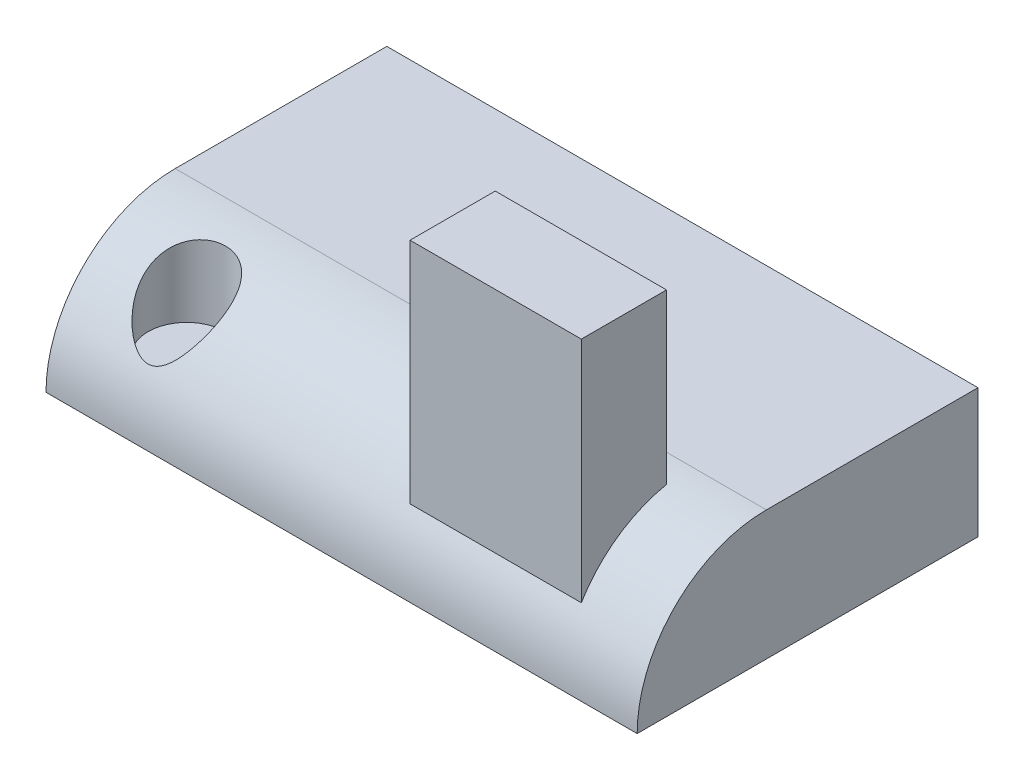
ISO-10303-21;
HEADER;
FILE_DESCRIPTION(('STEP AP214'),'2;1');
FILE_NAME('part.step','',(''),(''),'','','');
FILE_SCHEMA(('AUTOMOTIVE_DESIGN { 1 0 10303 214 1 1 1 1 }'));
ENDSEC;
DATA;
#1=APPLICATION_CONTEXT('core data for automotive mechanical design processes');
#2=APPLICATION_PROTOCOL_DEFINITION('international standard','automotive_design',2000,#1);
#3=PRODUCT_CONTEXT('',#1,'mechanical');
#4=PRODUCT('Part','Part','',(#3));
#5=PRODUCT_RELATED_PRODUCT_CATEGORY('part','',(#4));
#6=PRODUCT_DEFINITION_FORMATION('','',#4);
#7=PRODUCT_DEFINITION_CONTEXT('part definition',#1,'design');
#8=PRODUCT_DEFINITION('design','',#6,#7);
#9=PRODUCT_DEFINITION_SHAPE('','',#8);
#10=(LENGTH_UNIT() NAMED_UNIT(*) SI_UNIT(.MILLI.,.METRE.));
#11=(NAMED_UNIT(*) PLANE_ANGLE_UNIT() SI_UNIT($,.RADIAN.));
#12=(NAMED_UNIT(*) SI_UNIT($,.STERADIAN.) SOLID_ANGLE_UNIT());
#13=UNCERTAINTY_MEASURE_WITH_UNIT(LENGTH_MEASURE(1.E-05),#10,'distance_accuracy_value','');
#14=(GEOMETRIC_REPRESENTATION_CONTEXT(3) GLOBAL_UNCERTAINTY_ASSIGNED_CONTEXT((#13)) GLOBAL_UNIT_ASSIGNED_CONTEXT((#10,
#11,#12)) REPRESENTATION_CONTEXT('',''));
#15=CARTESIAN_POINT('',(0.,0.,0.));
#16=DIRECTION('',(0.,0.,1.));
#17=DIRECTION('',(1.,0.,0.));
#18=AXIS2_PLACEMENT_3D('',#15,#16,#17);
#19=CARTESIAN_POINT('',(0.,16.51,0.));
#20=DIRECTION('',(0.,-1.,0.));
#21=DIRECTION('',(0.,0.,-1.));
#22=AXIS2_PLACEMENT_3D('',#19,#20,#21);
#23=PLANE('',#22);
#24=DIRECTION('',(0.,0.,-1.));
#25=VECTOR('',#24,1.);
#26=CARTESIAN_POINT('',(-73.6264453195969,16.51,33.3439137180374));
#27=LINE('',#26,#25);
#28=CARTESIAN_POINT('',(-73.6264453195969,16.51,0.323913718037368));
#29=VERTEX_POINT('',#28);
#30=CARTESIAN_POINT('',(-73.6264453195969,16.51,-53.7742885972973));
#31=VERTEX_POINT('',#30);
#32=EDGE_CURVE('E154',#29,#31,#27,.T.);
#33=ORIENTED_EDGE('',*,*,#32,.F.);
#34=DIRECTION('',(-1.,0.,0.));
#35=VECTOR('',#34,1.);
#36=CARTESIAN_POINT('',(0.,16.51,0.323913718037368));
#37=LINE('',#36,#35);
#38=CARTESIAN_POINT('',(77.4812330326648,16.51,0.323913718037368));
#39=VERTEX_POINT('',#38);
#40=EDGE_CURVE('E49',#29,#39,#37,.F.);
#41=ORIENTED_EDGE('',*,*,#40,.T.);
#42=DIRECTION('',(0.,0.,1.));
#43=VECTOR('',#42,1.);
#44=CARTESIAN_POINT('',(77.4812330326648,16.51,33.3439137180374));
#45=LINE('',#44,#43);
#46=CARTESIAN_POINT('',(77.4812330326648,16.51,-53.7742885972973));
#47=VERTEX_POINT('',#46);
#48=EDGE_CURVE('E157',#47,#39,#45,.T.);
#49=ORIENTED_EDGE('',*,*,#48,.F.);
#50=DIRECTION('',(1.,0.,0.));
#51=VECTOR('',#50,1.);
#52=CARTESIAN_POINT('',(-73.6264453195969,16.51,-53.7742885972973));
#53=LINE('',#52,#51);
#54=EDGE_CURVE('E97',#31,#47,#53,.T.);
#55=ORIENTED_EDGE('',*,*,#54,.F.);
#56=EDGE_LOOP('',(#33,#41,#49,#55));
#57=FACE_BOUND('',#56,.T.);
#58=ADVANCED_FACE('F35',(#57),#23,.F.);
#59=CARTESIAN_POINT('',(-73.6264453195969,-16.51,33.3439137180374));
#60=DIRECTION('',(1.,0.,0.));
#61=DIRECTION('',(0.,0.,-1.));
#62=AXIS2_PLACEMENT_3D('',#59,#60,#61);
#63=PLANE('',#62);
#64=DIRECTION('',(0.,0.,-1.));
#65=VECTOR('',#64,1.);
#66=CARTESIAN_POINT('',(-73.6264453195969,-16.51,33.3439137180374));
#67=LINE('',#66,#65);
#68=CARTESIAN_POINT('',(-73.6264453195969,-16.51,33.3439137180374));
#69=VERTEX_POINT('',#68);
#70=CARTESIAN_POINT('',(-73.6264453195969,-16.51,-53.7742885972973));
#71=VERTEX_POINT('',#70);
#72=EDGE_CURVE('E155',#69,#71,#67,.T.);
#73=ORIENTED_EDGE('',*,*,#72,.F.);
#74=CARTESIAN_POINT('',(-73.6264453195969,-16.51,0.323913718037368));
#75=DIRECTION('',(1.,0.,0.));
#76=DIRECTION('',(0.,0.,-1.));
#77=AXIS2_PLACEMENT_3D('',#74,#75,#76);
#78=CIRCLE('',#77,33.02);
#79=EDGE_CURVE('E81',#69,#29,#78,.F.);
#80=ORIENTED_EDGE('',*,*,#79,.T.);
#81=ORIENTED_EDGE('',*,*,#32,.T.);
#82=DIRECTION('',(0.,1.,0.));
#83=VECTOR('',#82,1.);
#84=CARTESIAN_POINT('',(-73.6264453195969,-16.51,-53.7742885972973));
#85=LINE('',#84,#83);
#86=EDGE_CURVE('E169',#71,#31,#85,.T.);
#87=ORIENTED_EDGE('',*,*,#86,.F.);
#88=EDGE_LOOP('',(#73,#80,#81,#87));
#89=FACE_BOUND('',#88,.T.);
#90=ADVANCED_FACE('F197',(#89),#63,.F.);
#91=CARTESIAN_POINT('',(-73.6264453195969,-16.51,-53.7742885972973));
#92=DIRECTION('',(0.,0.,1.));
#93=DIRECTION('',(1.,0.,0.));
#94=AXIS2_PLACEMENT_3D('',#91,#92,#93);
#95=PLANE('',#94);
#96=ORIENTED_EDGE('',*,*,#54,.T.);
#97=DIRECTION('',(0.,1.,0.));
#98=VECTOR('',#97,1.);
#99=CARTESIAN_POINT('',(77.4812330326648,-16.51,-53.7742885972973));
#100=LINE('',#99,#98);
#101=CARTESIAN_POINT('',(77.4812330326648,-16.51,-53.7742885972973));
#102=VERTEX_POINT('',#101);
#103=EDGE_CURVE('E164',#102,#47,#100,.T.);
#104=ORIENTED_EDGE('',*,*,#103,.F.);
#105=DIRECTION('',(1.,0.,0.));
#106=VECTOR('',#105,1.);
#107=CARTESIAN_POINT('',(-73.6264453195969,-16.51,-53.7742885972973));
#108=LINE('',#107,#106);
#109=EDGE_CURVE('E102',#71,#102,#108,.T.);
#110=ORIENTED_EDGE('',*,*,#109,.F.);
#111=ORIENTED_EDGE('',*,*,#86,.T.);
#112=EDGE_LOOP('',(#96,#104,#110,#111));
#113=FACE_BOUND('',#112,.T.);
#114=ADVANCED_FACE('F202',(#113),#95,.F.);
#115=CARTESIAN_POINT('',(77.4812330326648,-16.51,33.3439137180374));
#116=DIRECTION('',(-1.,0.,0.));
#117=DIRECTION('',(0.,0.,1.));
#118=AXIS2_PLACEMENT_3D('',#115,#116,#117);
#119=PLANE('',#118);
#120=ORIENTED_EDGE('',*,*,#48,.T.);
#121=CARTESIAN_POINT('',(77.4812330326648,-16.51,0.323913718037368));
#122=DIRECTION('',(-1.,0.,0.));
#123=DIRECTION('',(0.,0.,1.));
#124=AXIS2_PLACEMENT_3D('',#121,#122,#123);
#125=CIRCLE('',#124,33.02);
#126=CARTESIAN_POINT('',(77.4812330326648,-16.51,33.3439137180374));
#127=VERTEX_POINT('',#126);
#128=EDGE_CURVE('E11',#39,#127,#125,.F.);
#129=ORIENTED_EDGE('',*,*,#128,.T.);
#130=DIRECTION('',(0.,0.,1.));
#131=VECTOR('',#130,1.);
#132=CARTESIAN_POINT('',(77.4812330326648,-16.51,33.3439137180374));
#133=LINE('',#132,#131);
#134=EDGE_CURVE('E159',#102,#127,#133,.T.);
#135=ORIENTED_EDGE('',*,*,#134,.F.);
#136=ORIENTED_EDGE('',*,*,#103,.T.);
#137=EDGE_LOOP('',(#120,#129,#135,#136));
#138=FACE_BOUND('',#137,.T.);
#139=ADVANCED_FACE('F208',(#138),#119,.F.);
#140=CARTESIAN_POINT('',(0.,-16.51,0.));
#141=DIRECTION('',(0.,-1.,0.));
#142=DIRECTION('',(0.,0.,-1.));
#143=AXIS2_PLACEMENT_3D('',#140,#141,#142);
#144=PLANE('',#143);
#145=ORIENTED_EDGE('',*,*,#72,.T.);
#146=ORIENTED_EDGE('',*,*,#109,.T.);
#147=ORIENTED_EDGE('',*,*,#134,.T.);
#148=DIRECTION('',(-1.,0.,0.));
#149=VECTOR('',#148,1.);
#150=CARTESIAN_POINT('',(-73.6264453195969,-16.51,33.3439137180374));
#151=LINE('',#150,#149);
#152=EDGE_CURVE('E162',#127,#69,#151,.T.);
#153=ORIENTED_EDGE('',*,*,#152,.T.);
#154=EDGE_LOOP('',(#145,#146,#147,#153));
#155=FACE_BOUND('',#154,.T.);
#156=ADVANCED_FACE('F206',(#155),#144,.T.);
#157=CARTESIAN_POINT('',(58.4481436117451,58.928,28.5849174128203));
#158=DIRECTION('',(-1.,0.,0.));
#159=DIRECTION('',(0.,0.,1.));
#160=AXIS2_PLACEMENT_3D('',#157,#158,#159);
#161=PLANE('',#160);
#162=CARTESIAN_POINT('',(58.4481436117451,-16.51,0.323913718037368));
#163=DIRECTION('',(-1.,0.,0.));
#164=DIRECTION('',(0.,0.,1.));
#165=AXIS2_PLACEMENT_3D('',#162,#163,#164);
#166=CIRCLE('',#165,33.02);
#167=CARTESIAN_POINT('',(58.4481436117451,0.567355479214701,28.5849174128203));
#168=VERTEX_POINT('',#167);
#169=CARTESIAN_POINT('',(58.4481436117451,15.8665996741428,6.81053021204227));
#170=VERTEX_POINT('',#169);
#171=EDGE_CURVE('E121',#168,#170,#166,.T.);
#172=ORIENTED_EDGE('',*,*,#171,.T.);
#173=DIRECTION('',(0.,-1.,0.));
#174=VECTOR('',#173,1.);
#175=CARTESIAN_POINT('',(58.4481436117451,58.928,6.81053021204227));
#176=LINE('',#175,#174);
#177=CARTESIAN_POINT('',(58.4481436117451,58.928,6.81053021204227));
#178=VERTEX_POINT('',#177);
#179=EDGE_CURVE('E152',#178,#170,#176,.T.);
#180=ORIENTED_EDGE('',*,*,#179,.F.);
#181=DIRECTION('',(0.,0.,-1.));
#182=VECTOR('',#181,1.);
#183=CARTESIAN_POINT('',(58.4481436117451,58.928,28.5849174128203));
#184=LINE('',#183,#182);
#185=CARTESIAN_POINT('',(58.4481436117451,58.928,28.5849174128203));
#186=VERTEX_POINT('',#185);
#187=EDGE_CURVE('E139',#186,#178,#184,.T.);
#188=ORIENTED_EDGE('',*,*,#187,.F.);
#189=DIRECTION('',(0.,-1.,0.));
#190=VECTOR('',#189,1.);
#191=CARTESIAN_POINT('',(58.4481436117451,58.928,28.5849174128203));
#192=LINE('',#191,#190);
#193=EDGE_CURVE('E135',#186,#168,#192,.T.);
#194=ORIENTED_EDGE('',*,*,#193,.T.);
#195=EDGE_LOOP('',(#172,#180,#188,#194));
#196=FACE_BOUND('',#195,.T.);
#197=ADVANCED_FACE('F141',(#196),#161,.F.);
#198=CARTESIAN_POINT('',(58.4481436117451,58.928,6.81053021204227));
#199=DIRECTION('',(0.,0.,1.));
#200=DIRECTION('',(1.,0.,0.));
#201=AXIS2_PLACEMENT_3D('',#198,#199,#200);
#202=PLANE('',#201);
#203=DIRECTION('',(-1.,0.,0.));
#204=VECTOR('',#203,1.);
#205=CARTESIAN_POINT('',(36.5579352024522,15.8665996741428,6.81053021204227));
#206=LINE('',#205,#204);
#207=CARTESIAN_POINT('',(14.6677267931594,15.8665996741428,6.81053021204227));
#208=VERTEX_POINT('',#207);
#209=EDGE_CURVE('E124',#170,#208,#206,.T.);
#210=ORIENTED_EDGE('',*,*,#209,.T.);
#211=DIRECTION('',(0.,-1.,0.));
#212=VECTOR('',#211,1.);
#213=CARTESIAN_POINT('',(14.6677267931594,58.928,6.81053021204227));
#214=LINE('',#213,#212);
#215=CARTESIAN_POINT('',(14.6677267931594,58.928,6.81053021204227));
#216=VERTEX_POINT('',#215);
#217=EDGE_CURVE('E144',#216,#208,#214,.T.);
#218=ORIENTED_EDGE('',*,*,#217,.F.);
#219=DIRECTION('',(-1.,0.,0.));
#220=VECTOR('',#219,1.);
#221=CARTESIAN_POINT('',(58.4481436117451,58.928,6.81053021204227));
#222=LINE('',#221,#220);
#223=EDGE_CURVE('E118',#178,#216,#222,.T.);
#224=ORIENTED_EDGE('',*,*,#223,.F.);
#225=ORIENTED_EDGE('',*,*,#179,.T.);
#226=EDGE_LOOP('',(#210,#218,#224,#225));
#227=FACE_BOUND('',#226,.T.);
#228=ADVANCED_FACE('F177',(#227),#202,.F.);
#229=CARTESIAN_POINT('',(14.6677267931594,58.928,28.5849174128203));
#230=DIRECTION('',(1.,0.,0.));
#231=DIRECTION('',(0.,0.,-1.));
#232=AXIS2_PLACEMENT_3D('',#229,#230,#231);
#233=PLANE('',#232);
#234=CARTESIAN_POINT('',(14.6677267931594,-16.51,0.323913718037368));
#235=DIRECTION('',(1.,0.,0.));
#236=DIRECTION('',(0.,0.,-1.));
#237=AXIS2_PLACEMENT_3D('',#234,#235,#236);
#238=CIRCLE('',#237,33.02);
#239=CARTESIAN_POINT('',(14.6677267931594,0.567355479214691,28.5849174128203));
#240=VERTEX_POINT('',#239);
#241=EDGE_CURVE('E140',#208,#240,#238,.T.);
#242=ORIENTED_EDGE('',*,*,#241,.T.);
#243=DIRECTION('',(0.,-1.,0.));
#244=VECTOR('',#243,1.);
#245=CARTESIAN_POINT('',(14.6677267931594,58.928,28.5849174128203));
#246=LINE('',#245,#244);
#247=CARTESIAN_POINT('',(14.6677267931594,58.928,28.5849174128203));
#248=VERTEX_POINT('',#247);
#249=EDGE_CURVE('E138',#248,#240,#246,.T.);
#250=ORIENTED_EDGE('',*,*,#249,.F.);
#251=DIRECTION('',(0.,0.,1.));
#252=VECTOR('',#251,1.);
#253=CARTESIAN_POINT('',(14.6677267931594,58.928,28.5849174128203));
#254=LINE('',#253,#252);
#255=EDGE_CURVE('E146',#216,#248,#254,.T.);
#256=ORIENTED_EDGE('',*,*,#255,.F.);
#257=ORIENTED_EDGE('',*,*,#217,.T.);
#258=EDGE_LOOP('',(#242,#250,#256,#257));
#259=FACE_BOUND('',#258,.T.);
#260=ADVANCED_FACE('F175',(#259),#233,.F.);
#261=CARTESIAN_POINT('',(58.4481436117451,58.928,28.5849174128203));
#262=DIRECTION('',(0.,0.,-1.));
#263=DIRECTION('',(-1.,0.,0.));
#264=AXIS2_PLACEMENT_3D('',#261,#262,#263);
#265=PLANE('',#264);
#266=DIRECTION('',(-1.,0.,0.));
#267=VECTOR('',#266,1.);
#268=CARTESIAN_POINT('',(36.5579352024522,0.567355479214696,28.5849174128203));
#269=LINE('',#268,#267);
#270=EDGE_CURVE('E74',#240,#168,#269,.F.);
#271=ORIENTED_EDGE('',*,*,#270,.T.);
#272=ORIENTED_EDGE('',*,*,#193,.F.);
#273=DIRECTION('',(1.,0.,0.));
#274=VECTOR('',#273,1.);
#275=CARTESIAN_POINT('',(58.4481436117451,58.928,28.5849174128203));
#276=LINE('',#275,#274);
#277=EDGE_CURVE('E142',#248,#186,#276,.T.);
#278=ORIENTED_EDGE('',*,*,#277,.F.);
#279=ORIENTED_EDGE('',*,*,#249,.T.);
#280=EDGE_LOOP('',(#271,#272,#278,#279));
#281=FACE_BOUND('',#280,.T.);
#282=ADVANCED_FACE('F133',(#281),#265,.F.);
#283=CARTESIAN_POINT('',(0.,58.928,0.));
#284=DIRECTION('',(0.,1.,0.));
#285=DIRECTION('',(0.,0.,1.));
#286=AXIS2_PLACEMENT_3D('',#283,#284,#285);
#287=PLANE('',#286);
#288=ORIENTED_EDGE('',*,*,#187,.T.);
#289=ORIENTED_EDGE('',*,*,#223,.T.);
#290=ORIENTED_EDGE('',*,*,#255,.T.);
#291=ORIENTED_EDGE('',*,*,#277,.T.);
#292=EDGE_LOOP('',(#288,#289,#290,#291));
#293=FACE_BOUND('',#292,.T.);
#294=ADVANCED_FACE('F251',(#293),#287,.T.);
#295=CARTESIAN_POINT('',(-51.3937950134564,-3.80999999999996,19.5835826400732));
#296=DIRECTION('',(0.,1.,0.));
#297=DIRECTION('',(0.,0.,1.));
#298=AXIS2_PLACEMENT_3D('',#295,#296,#297);
#299=CYLINDRICAL_SURFACE('',#298,9.91472841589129);
#300=CARTESIAN_POINT('',(-51.3937950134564,-3.80999999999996,19.5835826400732));
#301=DIRECTION('',(0.,1.,0.));
#302=DIRECTION('',(0.,0.,1.));
#303=AXIS2_PLACEMENT_3D('',#300,#301,#302);
#304=CIRCLE('',#303,9.91472841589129);
#305=CARTESIAN_POINT('',(-51.3937950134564,-3.80999999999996,29.4983110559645));
#306=VERTEX_POINT('',#305);
#307=EDGE_CURVE('E128',#306,#306,#304,.T.);
#308=ORIENTED_EDGE('',*,*,#307,.F.);
#309=EDGE_LOOP('',(#308));
#310=FACE_BOUND('',#309,.T.);
#311=CARTESIAN_POINT('',(-51.3937950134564,15.1600566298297,9.66885422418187));
#312=CARTESIAN_POINT('',(-51.6609748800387,15.160056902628,9.66885580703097));
#313=CARTESIAN_POINT('',(-51.9282022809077,15.1568729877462,9.67966466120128));
#314=CARTESIAN_POINT('',(-52.4608645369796,15.1440908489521,9.72281923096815));
#315=CARTESIAN_POINT('',(-52.7262984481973,15.1344894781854,9.75517551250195));
#316=CARTESIAN_POINT('',(-53.2538806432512,15.1087153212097,9.84122755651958));
#317=CARTESIAN_POINT('',(-53.5160218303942,15.0925302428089,9.8949632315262));
#318=CARTESIAN_POINT('',(-54.0346314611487,15.0533803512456,10.0232907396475));
#319=CARTESIAN_POINT('',(-54.2910998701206,15.0304154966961,10.0978827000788));
#320=CARTESIAN_POINT('',(-54.7963147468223,14.9774574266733,10.2671665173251));
#321=CARTESIAN_POINT('',(-55.0450678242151,14.9474704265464,10.3618405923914));
#322=CARTESIAN_POINT('',(-55.5333365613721,14.8801393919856,10.5704523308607));
#323=CARTESIAN_POINT('',(-55.7728519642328,14.8427951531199,10.6843905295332));
#324=CARTESIAN_POINT('',(-56.2408338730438,14.7604340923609,10.9303813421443));
#325=CARTESIAN_POINT('',(-56.4693066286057,14.7154216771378,11.0624235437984));
#326=CARTESIAN_POINT('',(-56.9137965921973,14.6173733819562,11.3434035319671));
#327=CARTESIAN_POINT('',(-57.1298138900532,14.5643375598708,11.4923411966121));
#328=CARTESIAN_POINT('',(-57.548452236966,14.4498083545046,11.8060125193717));
#329=CARTESIAN_POINT('',(-57.7510425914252,14.3882965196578,11.9707803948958));
#330=CARTESIAN_POINT('',(-58.1410656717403,14.2566518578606,12.3142156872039));
#331=CARTESIAN_POINT('',(-58.3284984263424,14.1865190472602,12.4928830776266));
#332=CARTESIAN_POINT('',(-58.687191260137,14.0374523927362,12.8623837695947));
#333=CARTESIAN_POINT('',(-58.8584502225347,13.9585179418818,13.0532179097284));
#334=CARTESIAN_POINT('',(-59.1839859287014,13.791773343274,13.445205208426));
#335=CARTESIAN_POINT('',(-59.3382623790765,13.7039630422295,13.6463585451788));
#336=CARTESIAN_POINT('',(-59.6329943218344,13.5171407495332,14.0623455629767));
#337=CARTESIAN_POINT('',(-59.7729968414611,13.4179001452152,14.277397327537));
#338=CARTESIAN_POINT('',(-60.0342371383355,13.2102654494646,14.7143525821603));
#339=CARTESIAN_POINT('',(-60.1554747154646,13.1018712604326,14.9362561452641));
#340=CARTESIAN_POINT('',(-60.3791354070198,12.8761880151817,15.3849701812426));
#341=CARTESIAN_POINT('',(-60.4815573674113,12.7588984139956,15.6117809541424));
#342=CARTESIAN_POINT('',(-60.6677714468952,12.5157872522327,16.0684686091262));
#343=CARTESIAN_POINT('',(-60.7515614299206,12.3899647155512,16.2983458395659));
#344=CARTESIAN_POINT('',(-60.9070522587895,12.1195240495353,16.7784808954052));
#345=CARTESIAN_POINT('',(-60.9771851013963,11.9742116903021,17.0288552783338));
#346=CARTESIAN_POINT('',(-61.096771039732,11.6747807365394,17.5292493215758));
#347=CARTESIAN_POINT('',(-61.1462235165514,11.5206618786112,17.7792689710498));
#348=CARTESIAN_POINT('',(-61.225346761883,11.2042416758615,18.2774179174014));
#349=CARTESIAN_POINT('',(-61.255007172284,11.0419360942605,18.5255461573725));
#350=CARTESIAN_POINT('',(-61.2954896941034,10.7099429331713,19.0183903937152));
#351=CARTESIAN_POINT('',(-61.306308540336,10.5402540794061,19.2631057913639));
#352=CARTESIAN_POINT('',(-61.3109393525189,10.120262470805,19.8515883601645));
#353=CARTESIAN_POINT('',(-61.2955067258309,9.86650145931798,20.1929897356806));
#354=CARTESIAN_POINT('',(-61.2312997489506,9.3475594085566,20.8638031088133));
#355=CARTESIAN_POINT('',(-61.1825135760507,9.08237435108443,21.1932108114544));
#356=CARTESIAN_POINT('',(-61.0543095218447,8.54235151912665,21.8384973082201));
#357=CARTESIAN_POINT('',(-60.9748536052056,8.26750214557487,22.1543587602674));
#358=CARTESIAN_POINT('',(-60.7878001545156,7.71046588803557,22.7707848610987));
#359=CARTESIAN_POINT('',(-60.6802051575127,7.42827966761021,23.071350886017));
#360=CARTESIAN_POINT('',(-60.4371405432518,6.8542184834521,23.66069625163));
#361=CARTESIAN_POINT('',(-60.3012811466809,6.56226189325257,23.9492346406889));
#362=CARTESIAN_POINT('',(-60.0043381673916,5.97469228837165,24.5091096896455));
#363=CARTESIAN_POINT('',(-59.8432525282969,5.67907897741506,24.780444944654));
#364=CARTESIAN_POINT('',(-59.4968918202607,5.08621110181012,25.3055253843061));
#365=CARTESIAN_POINT('',(-59.3116084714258,4.78895600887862,25.5592645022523));
#366=CARTESIAN_POINT('',(-58.917365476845,4.19528336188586,26.0486009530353));
#367=CARTESIAN_POINT('',(-58.7084095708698,3.89886568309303,26.2842011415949));
#368=CARTESIAN_POINT('',(-58.3014375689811,3.35628250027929,26.7009692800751));
#369=CARTESIAN_POINT('',(-58.1069131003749,3.10957987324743,26.8848546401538));
#370=CARTESIAN_POINT('',(-57.7001111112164,2.62089375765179,27.2389710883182));
#371=CARTESIAN_POINT('',(-57.4878305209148,2.37891109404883,27.4091998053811));
#372=CARTESIAN_POINT('',(-57.0447485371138,1.90306435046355,27.7349048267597));
#373=CARTESIAN_POINT('',(-56.8139821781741,1.66918606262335,27.8904078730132));
#374=CARTESIAN_POINT('',(-56.3318218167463,1.21317303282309,28.1857716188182));
#375=CARTESIAN_POINT('',(-56.0804409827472,0.99103094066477,28.3256421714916));
#376=CARTESIAN_POINT('',(-55.6765961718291,0.663412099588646,28.5269707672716));
#377=CARTESIAN_POINT('',(-55.5323477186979,0.55162337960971,28.5947018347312));
#378=CARTESIAN_POINT('',(-55.2367337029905,0.334363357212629,28.7246851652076));
#379=CARTESIAN_POINT('',(-55.0853674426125,0.228892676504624,28.7869368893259));
#380=CARTESIAN_POINT('',(-54.7752398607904,0.0259072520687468,28.9053406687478));
#381=CARTESIAN_POINT('',(-54.6164848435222,-0.0716140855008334,28.9614977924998));
#382=CARTESIAN_POINT('',(-54.2912215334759,-0.256870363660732,29.0670442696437));
#383=CARTESIAN_POINT('',(-54.1247128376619,-0.344604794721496,29.1164332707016));
#384=CARTESIAN_POINT('',(-53.6853008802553,-0.555172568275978,29.233870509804));
#385=CARTESIAN_POINT('',(-53.4063499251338,-0.669120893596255,29.2962839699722));
#386=CARTESIAN_POINT('',(-52.9752255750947,-0.80952805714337,29.3724669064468));
#387=CARTESIAN_POINT('',(-52.8294403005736,-0.851237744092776,29.3949514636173));
#388=CARTESIAN_POINT('',(-52.5342819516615,-0.923240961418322,29.4336202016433));
#389=CARTESIAN_POINT('',(-52.3849107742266,-0.953540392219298,29.449807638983));
#390=CARTESIAN_POINT('',(-52.0819407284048,-1.00189283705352,29.4755823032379));
#391=CARTESIAN_POINT('',(-51.9283135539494,-1.01980914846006,29.4850958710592));
#392=CARTESIAN_POINT('',(-51.6197958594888,-1.04212076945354,29.4969367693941));
#393=CARTESIAN_POINT('',(-51.464905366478,-1.04651636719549,29.4992642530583));
#394=CARTESIAN_POINT('',(-51.1553810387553,-1.04158870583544,29.49665206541));
#395=CARTESIAN_POINT('',(-51.0007472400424,-1.0322636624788,29.4917114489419));
#396=CARTESIAN_POINT('',(-50.6933000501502,-1.00031449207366,29.4747346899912));
#397=CARTESIAN_POINT('',(-50.540486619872,-0.977690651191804,29.4626987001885));
#398=CARTESIAN_POINT('',(-50.1301320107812,-0.899441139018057,29.4208906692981));
#399=CARTESIAN_POINT('',(-49.8754821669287,-0.831787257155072,29.3845921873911));
#400=CARTESIAN_POINT('',(-49.379552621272,-0.666555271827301,29.2948362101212));
#401=CARTESIAN_POINT('',(-49.1382788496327,-0.568964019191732,29.2413711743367));
#402=CARTESIAN_POINT('',(-48.6956595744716,-0.362540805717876,29.126558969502));
#403=CARTESIAN_POINT('',(-48.4928129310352,-0.256052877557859,29.0666817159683));
#404=CARTESIAN_POINT('',(-48.0985222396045,-0.0288083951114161,28.9369849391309));
#405=CARTESIAN_POINT('',(-47.9070863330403,0.091958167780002,28.8671584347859));
#406=CARTESIAN_POINT('',(-47.5345894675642,0.344769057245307,28.71860893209));
#407=CARTESIAN_POINT('',(-47.353561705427,0.476846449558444,28.6398596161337));
#408=CARTESIAN_POINT('',(-47.0016859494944,0.7494474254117,28.4745327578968));
#409=CARTESIAN_POINT('',(-46.8308418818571,0.889974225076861,28.3879522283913));
#410=CARTESIAN_POINT('',(-46.3665378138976,1.29170914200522,28.1359971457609));
#411=CARTESIAN_POINT('',(-46.0835372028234,1.56006911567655,27.962687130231));
#412=CARTESIAN_POINT('',(-45.5443388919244,2.10951346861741,27.5955776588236));
#413=CARTESIAN_POINT('',(-45.28816192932,2.39060745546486,27.4017625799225));
#414=CARTESIAN_POINT('',(-44.8002299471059,2.96052542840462,26.9949044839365));
#415=CARTESIAN_POINT('',(-44.5684986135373,3.24935657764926,26.7818431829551));
#416=CARTESIAN_POINT('',(-44.1285770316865,3.83071841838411,26.3375535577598));
#417=CARTESIAN_POINT('',(-43.9203806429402,4.12324812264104,26.1063299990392));
#418=CARTESIAN_POINT('',(-43.5132248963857,4.72996293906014,25.609261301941));
#419=CARTESIAN_POINT('',(-43.3159497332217,5.04422172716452,25.342124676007));
#420=CARTESIAN_POINT('',(-42.9483221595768,5.67111959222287,24.7880381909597));
#421=CARTESIAN_POINT('',(-42.7779734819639,5.98375843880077,24.5010855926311));
#422=CARTESIAN_POINT('',(-42.465678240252,6.60458054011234,23.9082432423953));
#423=CARTESIAN_POINT('',(-42.3237022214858,6.91276810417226,23.6023735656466));
#424=CARTESIAN_POINT('',(-42.0699312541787,7.52263671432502,22.9722015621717));
#425=CARTESIAN_POINT('',(-41.9581309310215,7.82431891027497,22.647902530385));
#426=CARTESIAN_POINT('',(-41.780622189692,8.37733789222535,22.0284834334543));
#427=CARTESIAN_POINT('',(-41.7106585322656,8.62982459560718,21.7356082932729));
#428=CARTESIAN_POINT('',(-41.5969668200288,9.12672538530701,21.1380829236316));
#429=CARTESIAN_POINT('',(-41.5532384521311,9.37113956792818,20.8334328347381));
#430=CARTESIAN_POINT('',(-41.4942531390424,9.85006516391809,20.2141239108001));
#431=CARTESIAN_POINT('',(-41.4789724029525,10.0845846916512,19.8994736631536));
#432=CARTESIAN_POINT('',(-41.4791616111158,10.5422361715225,19.2619904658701));
#433=CARTESIAN_POINT('',(-41.4946256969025,10.7653702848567,18.939159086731));
#434=CARTESIAN_POINT('',(-41.5528661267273,11.1595279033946,18.3466907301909));
#435=CARTESIAN_POINT('',(-41.5902221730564,11.3326991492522,18.0779443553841));
#436=CARTESIAN_POINT('',(-41.6883721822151,11.6693133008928,17.5386651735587));
#437=CARTESIAN_POINT('',(-41.7491615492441,11.8327581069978,17.2681327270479));
#438=CARTESIAN_POINT('',(-41.8952129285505,12.1490391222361,16.7275089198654));
#439=CARTESIAN_POINT('',(-41.9804703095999,12.3018773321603,16.4574174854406));
#440=CARTESIAN_POINT('',(-42.176255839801,12.5961981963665,15.9201771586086));
#441=CARTESIAN_POINT('',(-42.2867843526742,12.7376806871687,15.6530283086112));
#442=CARTESIAN_POINT('',(-42.5343956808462,13.0095596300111,15.1227441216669));
#443=CARTESIAN_POINT('',(-42.6716539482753,13.139874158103,14.8596484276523));
#444=CARTESIAN_POINT('',(-42.9722514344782,13.3878545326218,14.3425063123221));
#445=CARTESIAN_POINT('',(-43.1355912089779,13.5055201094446,14.0884600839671));
#446=CARTESIAN_POINT('',(-43.4877784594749,13.7278907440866,13.5928295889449));
#447=CARTESIAN_POINT('',(-43.6766151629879,13.8326012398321,13.3512401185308));
#448=CARTESIAN_POINT('',(-44.0788156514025,14.0290830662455,12.8837347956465));
#449=CARTESIAN_POINT('',(-44.2921762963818,14.1208560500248,12.6578169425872));
#450=CARTESIAN_POINT('',(-44.7155822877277,14.2816827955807,12.2501434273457));
#451=CARTESIAN_POINT('',(-44.923103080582,14.3521382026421,12.0663118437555));
#452=CARTESIAN_POINT('',(-45.3546962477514,14.4833827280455,11.7153896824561));
#453=CARTESIAN_POINT('',(-45.5787676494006,14.5441724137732,11.5482981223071));
#454=CARTESIAN_POINT('',(-46.0419039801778,14.6564468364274,11.2326750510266));
#455=CARTESIAN_POINT('',(-46.2809727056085,14.7079292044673,11.0841482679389));
#456=CARTESIAN_POINT('',(-46.7722202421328,14.8019700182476,10.8073441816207));
#457=CARTESIAN_POINT('',(-47.0243983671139,14.844528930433,10.6790658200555));
#458=CARTESIAN_POINT('',(-47.525828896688,14.9190539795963,10.4505428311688));
#459=CARTESIAN_POINT('',(-47.7744930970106,14.9514706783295,10.3491521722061));
#460=CARTESIAN_POINT('',(-48.2799713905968,15.009035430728,10.1666759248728));
#461=CARTESIAN_POINT('',(-48.5367850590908,15.034183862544,10.0855892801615));
#462=CARTESIAN_POINT('',(-49.0561831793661,15.0774647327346,9.94461534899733));
#463=CARTESIAN_POINT('',(-49.3187551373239,15.0956110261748,9.88468621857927));
#464=CARTESIAN_POINT('',(-49.8481676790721,15.1251845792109,9.78637362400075));
#465=CARTESIAN_POINT('',(-50.1150061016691,15.1366151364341,9.74797958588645));
#466=CARTESIAN_POINT('',(-50.5508520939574,15.1498737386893,9.703310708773));
#467=CARTESIAN_POINT('',(-50.7191488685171,15.1536940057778,9.69039452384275));
#468=CARTESIAN_POINT('',(-51.0562224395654,15.1587853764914,9.67316574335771));
#469=CARTESIAN_POINT('',(-51.2249992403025,15.1600564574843,9.66885322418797));
#470=CARTESIAN_POINT('',(-51.3937950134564,15.1600566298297,9.66885422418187));
#471=B_SPLINE_CURVE_WITH_KNOTS('',3,(#311,#312,#313,#314,#315,#316,#317,#318,#319,#320,#321,
#322,#323,#324,#325,#326,#327,#328,#329,#330,#331,#332,#333,#334,#335,#336,#337,#338,#339,#340,
#341,#342,#343,#344,#345,#346,#347,#348,#349,#350,#351,#352,#353,#354,#355,#356,#357,#358,#359,
#360,#361,#362,#363,#364,#365,#366,#367,#368,#369,#370,#371,#372,#373,#374,#375,#376,#377,#378,
#379,#380,#381,#382,#383,#384,#385,#386,#387,#388,#389,#390,#391,#392,#393,#394,#395,#396,#397,
#398,#399,#400,#401,#402,#403,#404,#405,#406,#407,#408,#409,#410,#411,#412,#413,#414,#415,#416,
#417,#418,#419,#420,#421,#422,#423,#424,#425,#426,#427,#428,#429,#430,#431,#432,#433,#434,#435,
#436,#437,#438,#439,#440,#441,#442,#443,#444,#445,#446,#447,#448,#449,#450,#451,#452,#453,#454,
#455,#456,#457,#458,#459,#460,#461,#462,#463,#464,#465,#466,#467,#468,#469,#470),.UNSPECIFIED.,
.T.,.F.,(4,2,2,2,2,2,2,2,2,2,2,2,2,2,2,2,2,2,2,2,2,2,2,2,2,2,2,2,2,2,2,2,2,2,2,2,2,2,2,2,2,2,2,
2,2,2,2,2,2,2,2,2,2,2,2,2,2,2,2,2,2,2,2,2,2,2,2,2,2,2,2,2,2,2,2,2,2,2,2,4),(0.,
0.801384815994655,1.60316288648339,2.40644484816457,3.20973171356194,4.01231025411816,
4.81491109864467,5.61705225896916,6.4191876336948,7.22309761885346,8.02700607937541,
8.83097000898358,9.63494782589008,10.4594352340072,11.2839314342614,12.1084781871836,
12.9331194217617,13.8258048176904,14.7185169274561,15.6116958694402,16.5050295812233,
17.7801593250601,19.0557412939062,20.3329102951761,21.6099641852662,22.9059599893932,
24.2020614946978,25.4986076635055,26.7949492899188,27.8863809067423,28.9780016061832,
30.0676002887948,31.1565082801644,31.7402305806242,32.3240102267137,32.9073006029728,
33.4906213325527,34.4098800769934,34.8692729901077,35.3284280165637,35.7925742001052,
36.2567104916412,36.7209071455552,37.1850938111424,37.9797387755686,38.7747332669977,
39.4840718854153,40.1939106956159,40.905900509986,41.618163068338,42.8964895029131,
44.1757970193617,45.4563329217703,46.7365339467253,48.1069292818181,49.4775144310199,
50.8466692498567,52.2155800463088,53.393428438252,54.5712627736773,55.7481116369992,
56.9247362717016,57.8894591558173,58.853992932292,59.8183442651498,60.7827094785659,
61.7536321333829,62.724575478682,63.695109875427,64.6655201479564,65.522564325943,
66.3795581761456,67.2367698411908,68.0939366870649,68.9044359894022,69.7148931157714,
70.5237382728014,71.3321859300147,71.8384709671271,72.344760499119),.UNSPECIFIED.);
#472=CARTESIAN_POINT('',(-51.3937950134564,15.1600566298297,9.66885422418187));
#473=VERTEX_POINT('',#472);
#474=EDGE_CURVE('E40',#473,#473,#471,.T.);
#475=ORIENTED_EDGE('',*,*,#474,.T.);
#476=EDGE_LOOP('',(#475));
#477=FACE_BOUND('',#476,.T.);
#478=ADVANCED_FACE('F188',(#310,#477),#299,.F.);
#479=CARTESIAN_POINT('',(-51.3937950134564,-3.80999999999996,19.5835826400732));
#480=DIRECTION('',(0.,1.,0.));
#481=DIRECTION('',(0.,0.,1.));
#482=AXIS2_PLACEMENT_3D('',#479,#480,#481);
#483=PLANE('',#482);
#484=ORIENTED_EDGE('',*,*,#307,.T.);
#485=EDGE_LOOP('',(#484));
#486=FACE_BOUND('',#485,.T.);
#487=ADVANCED_FACE('F190',(#486),#483,.T.);
#488=CARTESIAN_POINT('',(-73.6264453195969,-16.51,0.323913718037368));
#489=DIRECTION('',(-1.,0.,0.));
#490=DIRECTION('',(0.,0.,1.));
#491=AXIS2_PLACEMENT_3D('',#488,#489,#490);
#492=CYLINDRICAL_SURFACE('',#491,33.02);
#493=ORIENTED_EDGE('',*,*,#128,.F.);
#494=ORIENTED_EDGE('',*,*,#40,.F.);
#495=ORIENTED_EDGE('',*,*,#79,.F.);
#496=ORIENTED_EDGE('',*,*,#152,.F.);
#497=EDGE_LOOP('',(#493,#494,#495,#496));
#498=FACE_BOUND('',#497,.T.);
#499=ORIENTED_EDGE('',*,*,#171,.F.);
#500=ORIENTED_EDGE('',*,*,#270,.F.);
#501=ORIENTED_EDGE('',*,*,#241,.F.);
#502=ORIENTED_EDGE('',*,*,#209,.F.);
#503=EDGE_LOOP('',(#499,#500,#501,#502));
#504=FACE_BOUND('',#503,.T.);
#505=ORIENTED_EDGE('',*,*,#474,.F.);
#506=EDGE_LOOP('',(#505));
#507=FACE_BOUND('',#506,.T.);
#508=ADVANCED_FACE('F37',(#498,#504,#507),#492,.T.);
#509=CLOSED_SHELL('',(#58,#90,#114,#139,#156,#197,#228,#260,#282,#294,#478,#487,#508));
#510=MANIFOLD_SOLID_BREP('B2',#509);
#511=ADVANCED_BREP_SHAPE_REPRESENTATION('',(#18,#510),#14);
#512=SHAPE_DEFINITION_REPRESENTATION(#9,#511);
ENDSEC;
END-ISO-10303-21;
